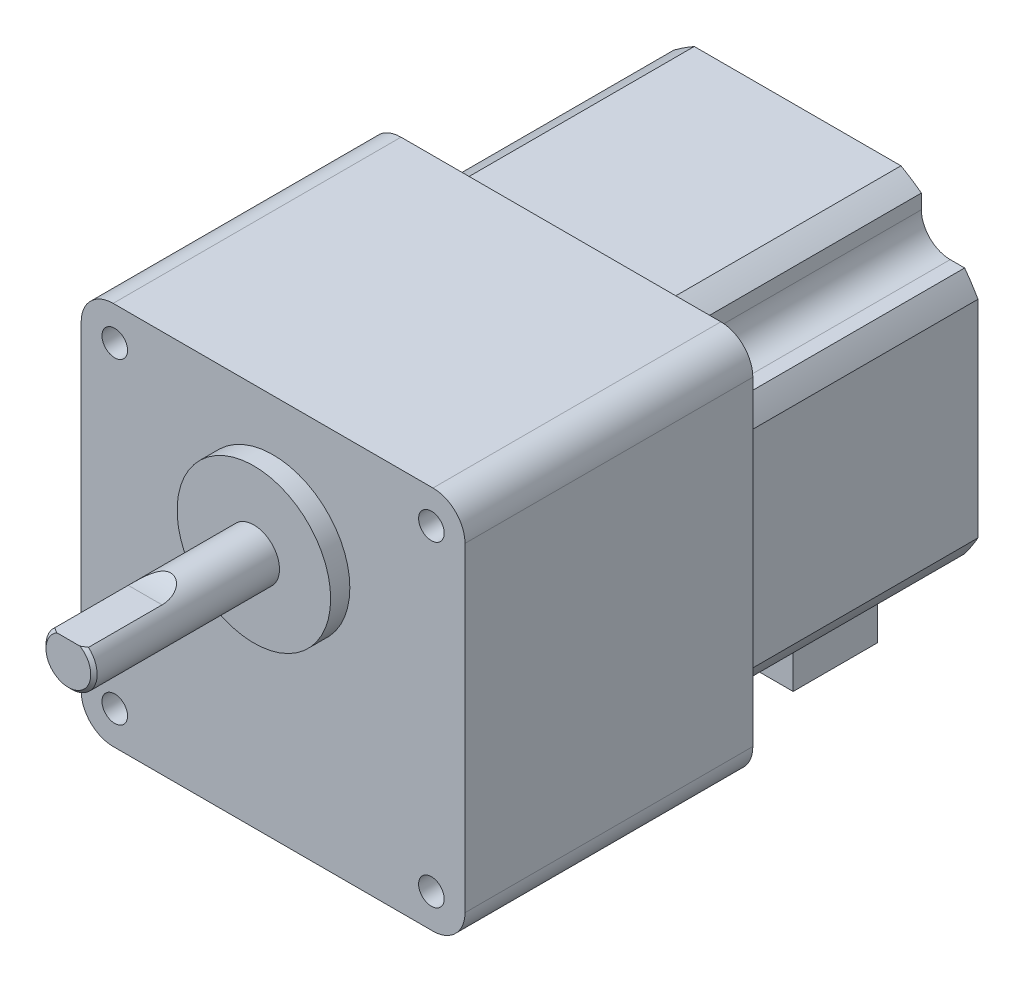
from build123d import *

# Parameters (mm, degrees)
SKETCH1_R       = 12
EXTRUDE1_DEPTH  = 3
SKETCH2_R       = 4
EXTRUDE2_DEPTH  = 29
CHAMFER1_SIZE   = 0.5
EXTRUDE3_DEPTH  = 5
EXTRUDE4_DEPTH  = 45
SKETCH6_W       = 38.7
SKETCH6_H       = 38.7
EXTRUDE6_DEPTH  = 37
FILLET1_R       = 4.5
SKETCH9_W       = 25
SKETCH9_H       = 13.2
EXTRUDE9_DEPTH  = 10
SKETCH10_R      = 2
EXTRUDE10_DEPTH = 8
SKETCH11_R      = 3.175
EXTRUDE11_DEPTH = 16
CHAMFER2_SIZE   = 1.5
CHAMFER2_SIZE2  = 0.401923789
SKETCH12_W      = 8.304897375
SKETCH12_H      = 3.204251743
EXTRUDE12_DEPTH = 15


with BuildPart() as part:
    # Sketch1 → Extrude1 (new body)
    with BuildSketch(Plane.XY):
        Circle(SKETCH1_R)
    extrude(amount=EXTRUDE1_DEPTH)

    # Sketch2 → Extrude2 (add)
    with BuildSketch(Plane.XY.offset(3)):
        with Locations(Location((0, 0, 0), (0, 0, 180))):
            Circle(SKETCH2_R)
    extrude(amount=EXTRUDE2_DEPTH)

    # Chamfer1
    chamfer1_edges = [part.edges().sort_by_distance(p)[0] for p in [
        (4, 0, 32),
    ]]
    chamfer(chamfer1_edges, length=CHAMFER1_SIZE)

    # Sketch3 → Extrude3 (cut, symmetric)
    with BuildSketch(Plane(origin=(0, 0, 0), x_dir=(0, 0, -1), z_dir=(1, 0, 0))):
        with BuildLine():
            Line((-32, 11.5), (-32, 3))
            Line((-32, 3), (-20, 3))
            ThreePointArc((-20, 3), (-26.01040764, 5.48959236), (-28.5, 11.5))
            Line((-28.5, 11.5), (-32, 11.5))
        make_face()
        with BuildLine():
            ThreePointArc((-28.5, 11.5), (-26.01040764, 5.48959236), (-20, 3))
            Line((-20, 3), (-20, 11.5))
            Line((-20, 11.5), (-28.5, 11.5))
        make_face()
        with BuildLine():
            Line((-20, 11.5), (-20, 3))
            ThreePointArc((-20, 3), (-13.98959236, 5.48959236), (-11.5, 11.5))
            ThreePointArc((-11.5, 11.5), (-20, 20), (-28.5, 11.5))
            Line((-28.5, 11.5), (-20, 11.5))
        make_face()
        with BuildLine():
            ThreePointArc((-28.5, 11.5), (-26.01040764, 5.48959236), (-20, 3))
            Line((-20, 3), (-20, 11.5))
            Line((-20, 11.5), (-28.5, 11.5))
        make_face()
        with BuildLine():
            Line((-20, 11.5), (-20, 3))
            ThreePointArc((-20, 3), (-13.98959236, 5.48959236), (-11.5, 11.5))
            ThreePointArc((-11.5, 11.5), (-20, 20), (-28.5, 11.5))
            Line((-28.5, 11.5), (-20, 11.5))
        make_face()
    extrude(amount=EXTRUDE3_DEPTH, both=True, mode=Mode.SUBTRACT)

    # Sketch4 → Extrude4 (add)
    with BuildSketch(Plane(origin=(0, 0, 0), x_dir=(-1, 0, 0), z_dir=(0, 0, -1))):
        with BuildLine():
            Line((-25, -40), (25, -40))
            ThreePointArc((25, -40), (28.535533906, -38.535533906), (30, -35))
            Line((30, -35), (30, 15))
            ThreePointArc((30, 15), (28.535533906, 18.535533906), (25, 20))
            Line((25, 20), (-25, 20))
            ThreePointArc((-25, 20), (-28.535533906, 18.535533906), (-30, 15))
            Line((-30, 15), (-30, -35))
            ThreePointArc((-30, -35), (-28.535533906, -38.535533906), (-25, -40))
        make_face()
    extrude(amount=EXTRUDE4_DEPTH)

    # Sketch6 → Extrude6 (add)
    with BuildSketch(Plane(origin=(0, 0, -45), x_dir=(-1, 0, 0), z_dir=(0, 0, -1))):
        with BuildLine():
            Line((-26.111826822, -29.35), (-19.35, -29.35))
            Line((-19.35, -29.35), (-19.35, 9.35))
            Line((-19.35, 9.35), (-26.111826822, 9.35))
            ThreePointArc((-26.111826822, 9.35), (-27.202837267, 7.783577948), (-28.2, 6.155803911))
            Line((-28.2, 6.155803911), (-28.2, -26.155803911))
            ThreePointArc((-28.2, -26.155803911), (-27.202837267, -27.783577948), (-26.111826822, -29.35))
        make_face()
        with BuildLine():
            Line((-19.35, 9.35), (19.35, 9.35))
            Line((19.35, 9.35), (19.35, 16.111826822))
            ThreePointArc((19.35, 16.111826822), (17.783577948, 17.202837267), (16.155803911, 18.2))
            Line((16.155803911, 18.2), (-16.155803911, 18.2))
            ThreePointArc((-16.155803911, 18.2), (-17.783577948, 17.202837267), (-19.35, 16.111826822))
            Line((-19.35, 16.111826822), (-19.35, 9.35))
        make_face()
        with BuildLine():
            Line((19.35, -29.35), (26.111826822, -29.35))
            ThreePointArc((26.111826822, -29.35), (27.202837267, -27.783577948), (28.2, -26.155803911))
            Line((28.2, -26.155803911), (28.2, 6.155803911))
            ThreePointArc((28.2, 6.155803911), (27.202837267, 7.783577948), (26.111826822, 9.35))
            Line((26.111826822, 9.35), (19.35, 9.35))
            Line((19.35, 9.35), (19.35, -29.35))
        make_face()
        with BuildLine():
            Line((19.35, -36.111826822), (19.35, -29.35))
            Line((19.35, -29.35), (-19.35, -29.35))
            Line((-19.35, -29.35), (-19.35, -36.111826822))
            ThreePointArc((-19.35, -36.111826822), (-17.783577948, -37.202837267), (-16.155803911, -38.2))
            Line((-16.155803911, -38.2), (16.155803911, -38.2))
            ThreePointArc((16.155803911, -38.2), (17.783577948, -37.202837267), (19.35, -36.111826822))
        make_face()
        with Locations((0, -10)):
            Rectangle(SKETCH6_W, SKETCH6_H)
    extrude(amount=EXTRUDE6_DEPTH)

    # Fillet1
    fillet1_edges = [part.edges().sort_by_distance(p)[0] for p in [
        (19.35, 9.35, -63.5),
        (19.35, -29.35, -63.5),
        (-19.35, -29.35, -63.5),
        (-19.35, 9.35, -63.5),
    ]]
    fillet(fillet1_edges, radius=FILLET1_R)

    # Sketch10 → Extrude10 (cut)
    with BuildSketch(Plane.XY):
        with Locations((24.748737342, 14.748737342)):
            Circle(SKETCH10_R)
        with Locations((-24.748737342, 14.748737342)):
            Circle(SKETCH10_R)
        with Locations((-24.748737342, -34.748737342)):
            Circle(SKETCH10_R)
        with Locations((24.748737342, -34.748737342)):
            Circle(SKETCH10_R)
    extrude(amount=-EXTRUDE10_DEPTH, mode=Mode.SUBTRACT)


with BuildPart() as body_2:
    # Sketch9 → Extrude9 (new body)
    with BuildSketch(Plane.XZ.offset(38.2)):
        with Locations((0, -75.4)):
            Rectangle(SKETCH9_W, SKETCH9_H)
    extrude(amount=EXTRUDE9_DEPTH)


with BuildPart() as body_3:
    # Sketch11 → Extrude11 (new body)
    with BuildSketch(Plane(origin=(0, 0, -82), x_dir=(-1, 0, 0), z_dir=(0, 0, -1))):
        with Locations((0, -10)):
            Circle(SKETCH11_R)
    extrude(amount=EXTRUDE11_DEPTH)

    # Chamfer2
    chamfer2_edges = [body_3.edges().sort_by_distance(p)[0] for p in [
        (3.175, -10, -98),
    ]]
    chamfer2_side = [body_3.faces().sort_by_distance(p)[0] for p in [
        (3.175, -10, -90),
    ]]
    chamfer(chamfer2_edges, length=CHAMFER2_SIZE, length2=CHAMFER2_SIZE2, reference=chamfer2_side[0])

    # Sketch12 → Extrude12 (cut)
    with BuildSketch(Plane(origin=(0, 0, -98), x_dir=(-1, 0, 0), z_dir=(0, 0, -1))):
        with Locations((0.566218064, -5.772874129)):
            Rectangle(SKETCH12_W, SKETCH12_H)
    extrude(amount=-EXTRUDE12_DEPTH, mode=Mode.SUBTRACT)


solid = Compound([part.part, body_2.part, body_3.part])
